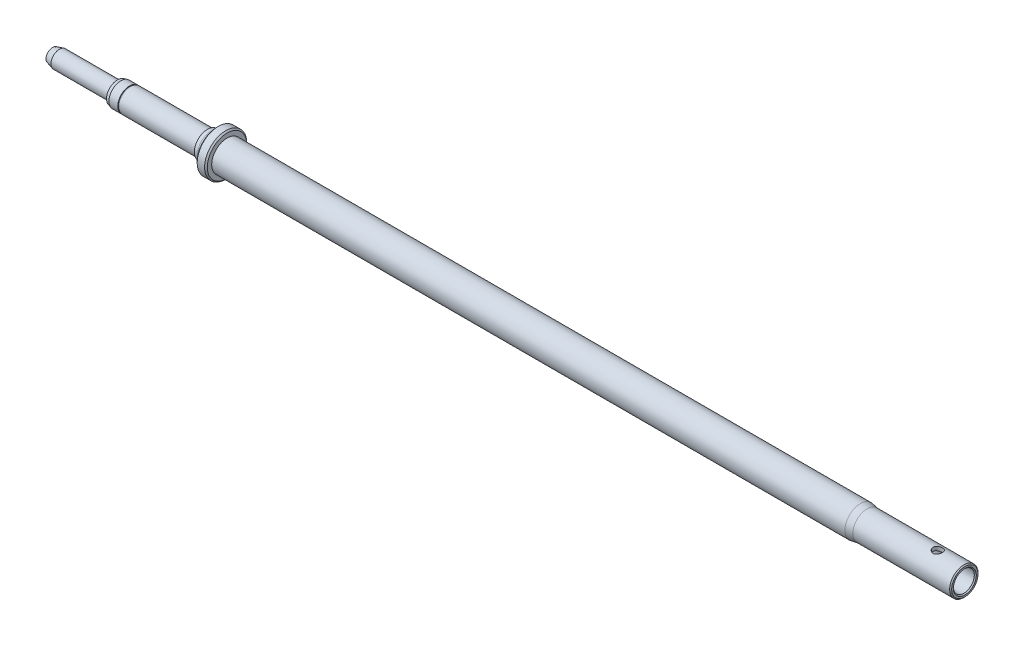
ISO-10303-21;
HEADER;
FILE_DESCRIPTION(('STEP AP214'),'2;1');
FILE_NAME('part.step','',(''),(''),'','','');
FILE_SCHEMA(('AUTOMOTIVE_DESIGN { 1 0 10303 214 1 1 1 1 }'));
ENDSEC;
DATA;
#1=APPLICATION_CONTEXT('core data for automotive mechanical design processes');
#2=APPLICATION_PROTOCOL_DEFINITION('international standard','automotive_design',2000,#1);
#3=PRODUCT_CONTEXT('',#1,'mechanical');
#4=PRODUCT('Part','Part','',(#3));
#5=PRODUCT_RELATED_PRODUCT_CATEGORY('part','',(#4));
#6=PRODUCT_DEFINITION_FORMATION('','',#4);
#7=PRODUCT_DEFINITION_CONTEXT('part definition',#1,'design');
#8=PRODUCT_DEFINITION('design','',#6,#7);
#9=PRODUCT_DEFINITION_SHAPE('','',#8);
#10=(LENGTH_UNIT() NAMED_UNIT(*) SI_UNIT(.MILLI.,.METRE.));
#11=(NAMED_UNIT(*) PLANE_ANGLE_UNIT() SI_UNIT($,.RADIAN.));
#12=(NAMED_UNIT(*) SI_UNIT($,.STERADIAN.) SOLID_ANGLE_UNIT());
#13=UNCERTAINTY_MEASURE_WITH_UNIT(LENGTH_MEASURE(1.E-05),#10,'distance_accuracy_value','');
#14=(GEOMETRIC_REPRESENTATION_CONTEXT(3) GLOBAL_UNCERTAINTY_ASSIGNED_CONTEXT((#13)) GLOBAL_UNIT_ASSIGNED_CONTEXT((#10,
#11,#12)) REPRESENTATION_CONTEXT('',''));
#15=CARTESIAN_POINT('',(0.,0.,0.));
#16=DIRECTION('',(0.,0.,1.));
#17=DIRECTION('',(1.,0.,0.));
#18=AXIS2_PLACEMENT_3D('',#15,#16,#17);
#19=CARTESIAN_POINT('',(-107.,0.,0.));
#20=DIRECTION('',(1.,0.,0.));
#21=DIRECTION('',(0.,0.,-1.));
#22=AXIS2_PLACEMENT_3D('',#19,#20,#21);
#23=CYLINDRICAL_SURFACE('',#22,17.5);
#24=CARTESIAN_POINT('',(-142.500000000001,0.,0.));
#25=DIRECTION('',(-1.,0.,0.));
#26=DIRECTION('',(0.,0.,1.));
#27=AXIS2_PLACEMENT_3D('',#24,#25,#26);
#28=CIRCLE('',#27,17.5);
#29=CARTESIAN_POINT('',(-142.500000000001,0.,17.5));
#30=VERTEX_POINT('',#29);
#31=EDGE_CURVE('E51',#30,#30,#28,.F.);
#32=ORIENTED_EDGE('',*,*,#31,.T.);
#33=EDGE_LOOP('',(#32));
#34=FACE_BOUND('',#33,.T.);
#35=CARTESIAN_POINT('',(-129.5,0.,0.));
#36=DIRECTION('',(-1.,0.,0.));
#37=DIRECTION('',(0.,0.,1.));
#38=AXIS2_PLACEMENT_3D('',#35,#36,#37);
#39=CIRCLE('',#38,17.5);
#40=CARTESIAN_POINT('',(-129.5,0.,17.5));
#41=VERTEX_POINT('',#40);
#42=EDGE_CURVE('E363',#41,#41,#39,.T.);
#43=ORIENTED_EDGE('',*,*,#42,.T.);
#44=EDGE_LOOP('',(#43));
#45=FACE_BOUND('',#44,.T.);
#46=ADVANCED_FACE('F31',(#34,#45),#23,.T.);
#47=CARTESIAN_POINT('',(-14.,0.,0.));
#48=DIRECTION('',(-1.,0.,0.));
#49=DIRECTION('',(0.,0.,1.));
#50=AXIS2_PLACEMENT_3D('',#47,#48,#49);
#51=CIRCLE('',#50,17.5);
#52=CARTESIAN_POINT('',(-14.,0.,17.5));
#53=VERTEX_POINT('',#52);
#54=EDGE_CURVE('E336',#53,#53,#51,.T.);
#55=ORIENTED_EDGE('',*,*,#54,.T.);
#56=EDGE_LOOP('',(#55));
#57=FACE_BOUND('',#56,.T.);
#58=CARTESIAN_POINT('',(-127.9,0.,0.));
#59=DIRECTION('',(-1.,0.,0.));
#60=DIRECTION('',(0.,0.,1.));
#61=AXIS2_PLACEMENT_3D('',#58,#59,#60);
#62=CIRCLE('',#61,17.5);
#63=CARTESIAN_POINT('',(-127.9,0.,17.5));
#64=VERTEX_POINT('',#63);
#65=EDGE_CURVE('E361',#64,#64,#62,.T.);
#66=ORIENTED_EDGE('',*,*,#65,.F.);
#67=EDGE_LOOP('',(#66));
#68=FACE_BOUND('',#67,.T.);
#69=ADVANCED_FACE('F148',(#57,#68),#23,.T.);
#70=CARTESIAN_POINT('',(-147.5,0.,0.));
#71=DIRECTION('',(-1.,0.,0.));
#72=DIRECTION('',(0.,0.,1.));
#73=AXIS2_PLACEMENT_3D('',#70,#71,#72);
#74=PLANE('',#73);
#75=CARTESIAN_POINT('',(-147.5,0.,0.));
#76=DIRECTION('',(-1.,0.,0.));
#77=DIRECTION('',(0.,0.,1.));
#78=AXIS2_PLACEMENT_3D('',#75,#76,#77);
#79=CIRCLE('',#78,16.1602540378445);
#80=CARTESIAN_POINT('',(-147.5,0.,16.1602540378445));
#81=VERTEX_POINT('',#80);
#82=EDGE_CURVE('E54',#81,#81,#79,.T.);
#83=ORIENTED_EDGE('',*,*,#82,.T.);
#84=EDGE_LOOP('',(#83));
#85=FACE_BOUND('',#84,.T.);
#86=CARTESIAN_POINT('',(-147.5,0.,0.));
#87=DIRECTION('',(-1.,0.,0.));
#88=DIRECTION('',(0.,0.,1.));
#89=AXIS2_PLACEMENT_3D('',#86,#87,#88);
#90=CIRCLE('',#89,12.5);
#91=CARTESIAN_POINT('',(-147.5,0.,12.5));
#92=VERTEX_POINT('',#91);
#93=EDGE_CURVE('E334',#92,#92,#90,.T.);
#94=ORIENTED_EDGE('',*,*,#93,.F.);
#95=EDGE_LOOP('',(#94));
#96=FACE_BOUND('',#95,.T.);
#97=ADVANCED_FACE('F154',(#85,#96),#74,.T.);
#98=CARTESIAN_POINT('',(-14.,0.,0.));
#99=DIRECTION('',(-1.,0.,0.));
#100=DIRECTION('',(0.,0.,1.));
#101=AXIS2_PLACEMENT_3D('',#98,#99,#100);
#102=PLANE('',#101);
#103=CARTESIAN_POINT('',(-14.,0.,0.));
#104=DIRECTION('',(-1.,0.,0.));
#105=DIRECTION('',(0.,0.,1.));
#106=AXIS2_PLACEMENT_3D('',#103,#104,#105);
#107=CIRCLE('',#106,19.5);
#108=CARTESIAN_POINT('',(-14.,0.,19.5));
#109=VERTEX_POINT('',#108);
#110=EDGE_CURVE('E87',#109,#109,#107,.T.);
#111=ORIENTED_EDGE('',*,*,#110,.T.);
#112=EDGE_LOOP('',(#111));
#113=FACE_BOUND('',#112,.T.);
#114=ORIENTED_EDGE('',*,*,#54,.F.);
#115=EDGE_LOOP('',(#114));
#116=FACE_BOUND('',#115,.T.);
#117=ADVANCED_FACE('F124',(#113,#116),#102,.T.);
#118=CARTESIAN_POINT('',(0.,0.,0.));
#119=DIRECTION('',(1.,0.,0.));
#120=DIRECTION('',(0.,0.,-1.));
#121=AXIS2_PLACEMENT_3D('',#118,#119,#120);
#122=PLANE('',#121);
#123=CARTESIAN_POINT('',(0.,0.,0.));
#124=DIRECTION('',(1.,0.,0.));
#125=DIRECTION('',(0.,0.,-1.));
#126=AXIS2_PLACEMENT_3D('',#123,#124,#125);
#127=CIRCLE('',#126,28.5);
#128=CARTESIAN_POINT('',(0.,0.,-28.5));
#129=VERTEX_POINT('',#128);
#130=EDGE_CURVE('E11',#129,#129,#127,.T.);
#131=ORIENTED_EDGE('',*,*,#130,.T.);
#132=EDGE_LOOP('',(#131));
#133=FACE_BOUND('',#132,.T.);
#134=CARTESIAN_POINT('',(0.,0.,0.));
#135=DIRECTION('',(1.,0.,0.));
#136=DIRECTION('',(0.,0.,-1.));
#137=AXIS2_PLACEMENT_3D('',#134,#135,#136);
#138=CIRCLE('',#137,29.25);
#139=CARTESIAN_POINT('',(0.,0.,-29.25));
#140=VERTEX_POINT('',#139);
#141=EDGE_CURVE('E57',#140,#140,#138,.F.);
#142=ORIENTED_EDGE('',*,*,#141,.T.);
#143=EDGE_LOOP('',(#142));
#144=FACE_BOUND('',#143,.T.);
#145=ADVANCED_FACE('F121',(#133,#144),#122,.F.);
#146=CARTESIAN_POINT('',(963.5,0.,0.));
#147=DIRECTION('',(-1.,0.,0.));
#148=DIRECTION('',(0.,0.,1.));
#149=AXIS2_PLACEMENT_3D('',#146,#147,#148);
#150=CYLINDRICAL_SURFACE('',#149,22.75);
#151=CARTESIAN_POINT('',(953.5,0.,0.));
#152=DIRECTION('',(-1.,0.,0.));
#153=DIRECTION('',(0.,0.,1.));
#154=AXIS2_PLACEMENT_3D('',#151,#152,#153);
#155=CIRCLE('',#154,22.75);
#156=CARTESIAN_POINT('',(953.5,0.,22.75));
#157=VERTEX_POINT('',#156);
#158=EDGE_CURVE('E209',#157,#157,#155,.T.);
#159=ORIENTED_EDGE('',*,*,#158,.T.);
#160=EDGE_LOOP('',(#159));
#161=FACE_BOUND('',#160,.T.);
#162=CARTESIAN_POINT('',(15.,0.,0.));
#163=DIRECTION('',(-1.,0.,0.));
#164=DIRECTION('',(0.,0.,1.));
#165=AXIS2_PLACEMENT_3D('',#162,#163,#164);
#166=CIRCLE('',#165,22.75);
#167=CARTESIAN_POINT('',(15.,0.,22.75));
#168=VERTEX_POINT('',#167);
#169=EDGE_CURVE('E69',#168,#168,#166,.T.);
#170=ORIENTED_EDGE('',*,*,#169,.F.);
#171=EDGE_LOOP('',(#170));
#172=FACE_BOUND('',#171,.T.);
#173=ADVANCED_FACE('F117',(#161,#172),#150,.T.);
#174=CARTESIAN_POINT('',(1108.5,0.,0.));
#175=DIRECTION('',(-1.,0.,0.));
#176=DIRECTION('',(0.,0.,1.));
#177=AXIS2_PLACEMENT_3D('',#174,#175,#176);
#178=CYLINDRICAL_SURFACE('',#177,21.);
#179=CARTESIAN_POINT('',(963.5,0.,0.));
#180=DIRECTION('',(-1.,0.,0.));
#181=DIRECTION('',(0.,0.,1.));
#182=AXIS2_PLACEMENT_3D('',#179,#180,#181);
#183=CIRCLE('',#182,21.);
#184=CARTESIAN_POINT('',(963.5,0.,21.));
#185=VERTEX_POINT('',#184);
#186=EDGE_CURVE('E207',#185,#185,#183,.T.);
#187=ORIENTED_EDGE('',*,*,#186,.F.);
#188=EDGE_LOOP('',(#187));
#189=FACE_BOUND('',#188,.T.);
#190=CARTESIAN_POINT('',(1107.,0.,0.));
#191=DIRECTION('',(1.,0.,0.));
#192=DIRECTION('',(0.,0.,-1.));
#193=AXIS2_PLACEMENT_3D('',#190,#191,#192);
#194=CIRCLE('',#193,21.);
#195=CARTESIAN_POINT('',(1107.,0.,-21.));
#196=VERTEX_POINT('',#195);
#197=EDGE_CURVE('E78',#196,#196,#194,.F.);
#198=ORIENTED_EDGE('',*,*,#197,.T.);
#199=EDGE_LOOP('',(#198));
#200=FACE_BOUND('',#199,.T.);
#201=CARTESIAN_POINT('',(1068.5,19.7989898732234,-6.99999999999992));
#202=CARTESIAN_POINT('',(1068.30939617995,19.7989898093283,-7.00000008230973));
#203=CARTESIAN_POINT('',(1068.11879354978,19.8017497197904,-6.99220858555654));
#204=CARTESIAN_POINT('',(1067.73894637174,19.8127016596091,-6.96111510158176));
#205=CARTESIAN_POINT('',(1067.54970234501,19.8208956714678,-6.93780745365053));
#206=CARTESIAN_POINT('',(1067.1740810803,19.8424521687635,-6.8759117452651));
#207=CARTESIAN_POINT('',(1066.98770315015,19.8558133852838,-6.83732743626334));
#208=CARTESIAN_POINT('',(1066.61901382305,19.887291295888,-6.7452213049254));
#209=CARTESIAN_POINT('',(1066.43670404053,19.9054098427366,-6.69169366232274));
#210=CARTESIAN_POINT('',(1066.07788274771,19.945800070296,-6.57032234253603));
#211=CARTESIAN_POINT('',(1065.90135848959,19.9680617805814,-6.50251298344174));
#212=CARTESIAN_POINT('',(1065.55471458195,20.0161241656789,-6.35302567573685));
#213=CARTESIAN_POINT('',(1065.38459721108,20.0419260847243,-6.271342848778));
#214=CARTESIAN_POINT('',(1065.05185931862,20.0963362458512,-6.09473563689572));
#215=CARTESIAN_POINT('',(1064.88923866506,20.1249444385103,-5.99981148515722));
#216=CARTESIAN_POINT('',(1064.57242309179,20.184192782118,-5.79736853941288));
#217=CARTESIAN_POINT('',(1064.41822851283,20.2148330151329,-5.68984923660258));
#218=CARTESIAN_POINT('',(1064.11379388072,20.2784580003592,-5.45884575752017));
#219=CARTESIAN_POINT('',(1063.96389146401,20.3114874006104,-5.33492870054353));
#220=CARTESIAN_POINT('',(1063.67500639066,20.3779489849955,-5.07515134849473));
#221=CARTESIAN_POINT('',(1063.53602037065,20.4113810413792,-4.93929475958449));
#222=CARTESIAN_POINT('',(1063.26969910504,20.4777783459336,-4.65636283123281));
#223=CARTESIAN_POINT('',(1063.14236981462,20.510743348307,-4.50928182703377));
#224=CARTESIAN_POINT('',(1062.90030588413,20.5752999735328,-4.20490454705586));
#225=CARTESIAN_POINT('',(1062.78556662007,20.6068920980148,-4.04761205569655));
#226=CARTESIAN_POINT('',(1062.56654051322,20.6686866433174,-3.71940914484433));
#227=CARTESIAN_POINT('',(1062.4626121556,20.6988298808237,-3.54824801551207));
#228=CARTESIAN_POINT('',(1062.26964362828,20.7559352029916,-3.19730250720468));
#229=CARTESIAN_POINT('',(1062.18059794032,20.7828984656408,-3.01752135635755));
#230=CARTESIAN_POINT('',(1062.01809826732,20.8328843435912,-2.65051368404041));
#231=CARTESIAN_POINT('',(1061.9446441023,20.8559070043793,-2.46328724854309));
#232=CARTESIAN_POINT('',(1061.81399798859,20.8973390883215,-2.08274846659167));
#233=CARTESIAN_POINT('',(1061.7568053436,20.9157487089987,-1.88943638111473));
#234=CARTESIAN_POINT('',(1061.66093397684,20.946857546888,-1.50500670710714));
#235=CARTESIAN_POINT('',(1061.62168052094,20.9597331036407,-1.3140466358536));
#236=CARTESIAN_POINT('',(1061.55921566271,20.9803149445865,-0.92924775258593));
#237=CARTESIAN_POINT('',(1061.53600361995,20.9880214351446,-0.735409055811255));
#238=CARTESIAN_POINT('',(1061.50585363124,20.9980446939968,-0.346372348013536));
#239=CARTESIAN_POINT('',(1061.49891223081,21.0003626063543,-0.151174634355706));
#240=CARTESIAN_POINT('',(1061.50136390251,20.9995453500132,0.239104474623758));
#241=CARTESIAN_POINT('',(1061.51075659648,20.9964103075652,0.434185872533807));
#242=CARTESIAN_POINT('',(1061.54508794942,20.9850078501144,0.81504891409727));
#243=CARTESIAN_POINT('',(1061.56939861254,20.9769478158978,1.00089379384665));
#244=CARTESIAN_POINT('',(1061.63278921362,20.9560895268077,1.36984010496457));
#245=CARTESIAN_POINT('',(1061.67187405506,20.9432896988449,1.55294060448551));
#246=CARTESIAN_POINT('',(1061.764453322,20.9132894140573,1.91502493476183));
#247=CARTESIAN_POINT('',(1061.8179431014,20.8960903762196,2.0940100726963));
#248=CARTESIAN_POINT('',(1061.93891325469,20.8577220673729,2.44682095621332));
#249=CARTESIAN_POINT('',(1062.00639890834,20.8365512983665,2.62064472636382));
#250=CARTESIAN_POINT('',(1062.15576674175,20.7904830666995,2.9641574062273));
#251=CARTESIAN_POINT('',(1062.2378216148,20.7655415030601,3.13376526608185));
#252=CARTESIAN_POINT('',(1062.41514075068,20.7127581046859,3.4655272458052));
#253=CARTESIAN_POINT('',(1062.51040953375,20.6849152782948,3.62767878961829));
#254=CARTESIAN_POINT('',(1062.71347915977,20.6270296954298,3.94352999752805));
#255=CARTESIAN_POINT('',(1062.8212807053,20.5969868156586,4.09722918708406));
#256=CARTESIAN_POINT('',(1063.04871709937,20.5354450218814,4.39529994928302));
#257=CARTESIAN_POINT('',(1063.16835237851,20.5039460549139,4.5396711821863));
#258=CARTESIAN_POINT('',(1063.42465644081,20.4387631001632,4.8248690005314));
#259=CARTESIAN_POINT('',(1063.56186321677,20.4050462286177,4.96520502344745));
#260=CARTESIAN_POINT('',(1063.84754675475,20.3377987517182,5.23384311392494));
#261=CARTESIAN_POINT('',(1063.99601997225,20.3042680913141,5.36214893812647));
#262=CARTESIAN_POINT('',(1064.30344676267,20.2382932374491,5.60601959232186));
#263=CARTESIAN_POINT('',(1064.46240581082,20.205849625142,5.72157768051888));
#264=CARTESIAN_POINT('',(1064.78969578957,20.1430032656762,5.93904281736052));
#265=CARTESIAN_POINT('',(1064.95802302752,20.1125997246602,6.04095519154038));
#266=CARTESIAN_POINT('',(1065.30559822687,20.0542870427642,6.23182809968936));
#267=CARTESIAN_POINT('',(1065.48497051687,20.0264212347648,6.32057577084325));
#268=CARTESIAN_POINT('',(1065.85106326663,19.9745851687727,6.48252880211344));
#269=CARTESIAN_POINT('',(1066.03778082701,19.9506133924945,6.55574022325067));
#270=CARTESIAN_POINT('',(1066.4172763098,19.9073407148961,6.68599283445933));
#271=CARTESIAN_POINT('',(1066.61005337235,19.888039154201,6.74303630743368));
#272=CARTESIAN_POINT('',(1067.00023361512,19.8547608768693,6.84040381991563));
#273=CARTESIAN_POINT('',(1067.19763655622,19.8407838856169,6.88072872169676));
#274=CARTESIAN_POINT('',(1067.58651906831,19.8191440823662,6.94280613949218));
#275=CARTESIAN_POINT('',(1067.77786394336,19.8112247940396,6.96531465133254));
#276=CARTESIAN_POINT('',(1068.161904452,19.8009462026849,6.99448151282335));
#277=CARTESIAN_POINT('',(1068.35460003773,19.7985867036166,7.00114042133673));
#278=CARTESIAN_POINT('',(1068.73983818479,19.7995056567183,6.99854105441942));
#279=CARTESIAN_POINT('',(1068.93238076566,19.8027832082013,6.98928532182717));
#280=CARTESIAN_POINT('',(1069.31587275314,19.814866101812,6.95495589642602));
#281=CARTESIAN_POINT('',(1069.5068221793,19.8236713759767,6.9298823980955));
#282=CARTESIAN_POINT('',(1069.87913913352,19.8461253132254,6.86530634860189));
#283=CARTESIAN_POINT('',(1070.06060960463,19.8595958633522,6.82633303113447));
#284=CARTESIAN_POINT('',(1070.41957944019,19.8910231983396,6.73420841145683));
#285=CARTESIAN_POINT('',(1070.59707746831,19.9089814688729,6.6810524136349));
#286=CARTESIAN_POINT('',(1070.94686460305,19.9488585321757,6.56102410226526));
#287=CARTESIAN_POINT('',(1071.11915486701,19.9707764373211,6.4941548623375));
#288=CARTESIAN_POINT('',(1071.45758944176,20.0179729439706,6.3471816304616));
#289=CARTESIAN_POINT('',(1071.62373138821,20.0432528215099,6.26707261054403));
#290=CARTESIAN_POINT('',(1071.95394763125,20.0973231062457,6.09149413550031));
#291=CARTESIAN_POINT('',(1072.11779377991,20.1261987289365,5.9956218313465));
#292=CARTESIAN_POINT('',(1072.4369547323,20.1860106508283,5.79105602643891));
#293=CARTESIAN_POINT('',(1072.59226656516,20.2169476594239,5.68235810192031));
#294=CARTESIAN_POINT('',(1072.89342701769,20.280052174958,5.45285650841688));
#295=CARTESIAN_POINT('',(1073.03927478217,20.312219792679,5.33205174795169));
#296=CARTESIAN_POINT('',(1073.32066248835,20.3769486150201,5.07907567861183));
#297=CARTESIAN_POINT('',(1073.45620219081,20.4095098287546,4.94690410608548));
#298=CARTESIAN_POINT('',(1073.72247587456,20.4757619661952,4.66530668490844));
#299=CARTESIAN_POINT('',(1073.85266035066,20.5094313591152,4.51535549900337));
#300=CARTESIAN_POINT('',(1074.09991645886,20.5753460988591,4.20479709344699));
#301=CARTESIAN_POINT('',(1074.21699246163,20.6075919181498,4.04419345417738));
#302=CARTESIAN_POINT('',(1074.43729084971,20.6697907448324,3.7132339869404));
#303=CARTESIAN_POINT('',(1074.54050796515,20.6997428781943,3.54287448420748));
#304=CARTESIAN_POINT('',(1074.73220002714,20.7564914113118,3.1936408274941));
#305=CARTESIAN_POINT('',(1074.82068115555,20.7832891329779,3.01477028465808));
#306=CARTESIAN_POINT('',(1074.98171475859,20.8328296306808,2.65079768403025));
#307=CARTESIAN_POINT('',(1075.05436256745,20.8555965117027,2.46574112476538));
#308=CARTESIAN_POINT('',(1075.18374912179,20.8966202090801,2.08973897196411));
#309=CARTESIAN_POINT('',(1075.24049422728,20.9148788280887,1.89879576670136));
#310=CARTESIAN_POINT('',(1075.33756921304,20.9463658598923,1.51239071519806));
#311=CARTESIAN_POINT('',(1075.37790070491,20.9595947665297,1.3169293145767));
#312=CARTESIAN_POINT('',(1075.44175002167,20.9806334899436,0.9229934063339));
#313=CARTESIAN_POINT('',(1075.4652685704,20.9884435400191,0.724519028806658));
#314=CARTESIAN_POINT('',(1075.49454500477,20.99817806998,0.335524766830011));
#315=CARTESIAN_POINT('',(1075.50108638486,21.0003621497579,0.145069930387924));
#316=CARTESIAN_POINT('',(1075.4986200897,20.9995400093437,-0.235726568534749));
#317=CARTESIAN_POINT('',(1075.48961272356,20.996533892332,-0.426068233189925));
#318=CARTESIAN_POINT('',(1075.45613705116,20.9854138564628,-0.805216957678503));
#319=CARTESIAN_POINT('',(1075.43167010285,20.9773003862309,-0.994024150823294));
#320=CARTESIAN_POINT('',(1075.36750678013,20.9561860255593,-1.36875331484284));
#321=CARTESIAN_POINT('',(1075.32781036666,20.9431851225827,-1.55467527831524));
#322=CARTESIAN_POINT('',(1075.23430921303,20.9128907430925,-1.91936009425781));
#323=CARTESIAN_POINT('',(1075.18074210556,20.8956698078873,-2.09819003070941));
#324=CARTESIAN_POINT('',(1075.05964158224,20.8572673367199,-2.45068233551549));
#325=CARTESIAN_POINT('',(1074.99210349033,20.8360844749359,-2.62434295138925));
#326=CARTESIAN_POINT('',(1074.84361726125,20.7902981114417,-2.96531471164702));
#327=CARTESIAN_POINT('',(1074.76267203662,20.7656953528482,-3.13262722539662));
#328=CARTESIAN_POINT('',(1074.58791970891,20.7136623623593,-3.46001136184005));
#329=CARTESIAN_POINT('',(1074.49410774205,20.6862310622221,-3.62008021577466));
#330=CARTESIAN_POINT('',(1074.29061940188,20.6281705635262,-3.93771390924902));
#331=CARTESIAN_POINT('',(1074.1804880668,20.5974610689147,-4.09497269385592));
#332=CARTESIAN_POINT('',(1073.94781609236,20.5345113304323,-4.39978136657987));
#333=CARTESIAN_POINT('',(1073.82527113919,20.5022705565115,-4.54732785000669));
#334=CARTESIAN_POINT('',(1073.56856191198,20.437096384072,-4.83181041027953));
#335=CARTESIAN_POINT('',(1073.43439615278,20.4041628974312,-4.96874512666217));
#336=CARTESIAN_POINT('',(1073.15526778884,20.3384640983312,-5.23117376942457));
#337=CARTESIAN_POINT('',(1073.01030505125,20.3056987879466,-5.35666755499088));
#338=CARTESIAN_POINT('',(1072.70451606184,20.2399307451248,-5.60015451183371));
#339=CARTESIAN_POINT('',(1072.54328976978,20.2069695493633,-5.71765714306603));
#340=CARTESIAN_POINT('',(1072.21116541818,20.1431429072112,-5.93860403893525));
#341=CARTESIAN_POINT('',(1072.04027080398,20.1122767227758,-6.04205326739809));
#342=CARTESIAN_POINT('',(1071.6898247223,20.0535568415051,-6.23417637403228));
#343=CARTESIAN_POINT('',(1071.51027161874,20.0257037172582,-6.32284744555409));
#344=CARTESIAN_POINT('',(1071.1438274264,19.9739067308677,-6.4846177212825));
#345=CARTESIAN_POINT('',(1070.95693968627,19.9499611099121,-6.55772393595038));
#346=CARTESIAN_POINT('',(1070.58560553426,19.9077187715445,-6.68483486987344));
#347=CARTESIAN_POINT('',(1070.40142512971,19.8892169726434,-6.7395488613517));
#348=CARTESIAN_POINT('',(1070.02885928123,19.8570639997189,-6.83370236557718));
#349=CARTESIAN_POINT('',(1069.84047560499,19.8434108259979,-6.87314817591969));
#350=CARTESIAN_POINT('',(1069.46081464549,19.8213838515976,-6.93641601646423));
#351=CARTESIAN_POINT('',(1069.26953766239,19.8130095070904,-6.96023965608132));
#352=CARTESIAN_POINT('',(1068.88550670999,19.8018125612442,-6.99203157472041));
#353=CARTESIAN_POINT('',(1068.69275274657,19.7989899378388,-6.99999991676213));
#354=CARTESIAN_POINT('',(1068.5,19.7989898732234,-6.99999999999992));
#355=B_SPLINE_CURVE_WITH_KNOTS('',3,(#201,#202,#203,#204,#205,#206,#207,#208,#209,#210,#211,
#212,#213,#214,#215,#216,#217,#218,#219,#220,#221,#222,#223,#224,#225,#226,#227,#228,#229,#230,
#231,#232,#233,#234,#235,#236,#237,#238,#239,#240,#241,#242,#243,#244,#245,#246,#247,#248,#249,
#250,#251,#252,#253,#254,#255,#256,#257,#258,#259,#260,#261,#262,#263,#264,#265,#266,#267,#268,
#269,#270,#271,#272,#273,#274,#275,#276,#277,#278,#279,#280,#281,#282,#283,#284,#285,#286,#287,
#288,#289,#290,#291,#292,#293,#294,#295,#296,#297,#298,#299,#300,#301,#302,#303,#304,#305,#306,
#307,#308,#309,#310,#311,#312,#313,#314,#315,#316,#317,#318,#319,#320,#321,#322,#323,#324,#325,
#326,#327,#328,#329,#330,#331,#332,#333,#334,#335,#336,#337,#338,#339,#340,#341,#342,#343,#344,
#345,#346,#347,#348,#349,#350,#351,#352,#353,#354),.UNSPECIFIED.,.T.,.F.,(4,2,2,2,2,2,2,2,2,2,2,
2,2,2,2,2,2,2,2,2,2,2,2,2,2,2,2,2,2,2,2,2,2,2,2,2,2,2,2,2,2,2,2,2,2,2,2,2,2,2,2,2,2,2,2,2,2,2,2,
2,2,2,2,2,2,2,2,2,2,2,2,2,2,2,2,2,4),(0.,0.571631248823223,1.14347115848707,1.71517072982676,
2.28709328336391,2.85765690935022,3.42842158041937,3.99917620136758,4.56995388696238,
5.1611060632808,5.75207538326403,6.34334495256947,6.93439663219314,7.54114407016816,
8.14766603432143,8.75418099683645,9.36066998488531,9.94606516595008,10.5314369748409,
11.1166844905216,11.7019184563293,12.2640617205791,12.8263917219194,13.388540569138,
13.9509018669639,14.5204380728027,15.0901695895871,15.6599330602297,16.2297172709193,
16.8264489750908,17.4229937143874,18.0198524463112,18.6164775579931,19.2218898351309,
19.8270654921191,20.4321556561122,21.0372146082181,21.6149690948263,22.192703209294,
22.770345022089,23.3479797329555,23.9056293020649,24.4634637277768,25.0211732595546,
25.5790950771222,26.154509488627,26.7301229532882,27.3057883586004,27.8814671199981,
28.4849894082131,29.0883098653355,29.6918590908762,30.2951544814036,30.8947103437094,
31.4940260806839,32.0932829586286,32.692514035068,33.2635544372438,33.8345834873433,
34.4055623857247,34.9765427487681,35.5383229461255,36.1002914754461,36.6621380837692,
37.2241976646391,37.8068280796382,38.3896616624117,38.9725698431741,39.5554851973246,
40.1613742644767,40.7670487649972,41.3728381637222,41.9783541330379,42.5567308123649,
43.1348686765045,43.7129469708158,44.2910229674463),.UNSPECIFIED.);
#356=CARTESIAN_POINT('',(1068.5,19.7989898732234,-6.99999999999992));
#357=VERTEX_POINT('',#356);
#358=EDGE_CURVE('E86',#357,#357,#355,.T.);
#359=ORIENTED_EDGE('',*,*,#358,.F.);
#360=EDGE_LOOP('',(#359));
#361=FACE_BOUND('',#360,.T.);
#362=ADVANCED_FACE('F112',(#189,#200,#361),#178,.T.);
#363=CARTESIAN_POINT('',(90.5,0.,0.));
#364=DIRECTION('',(1.,0.,0.));
#365=DIRECTION('',(0.,0.,-1.));
#366=AXIS2_PLACEMENT_3D('',#363,#364,#365);
#367=CYLINDRICAL_SURFACE('',#366,15.5);
#368=CARTESIAN_POINT('',(1107.,0.,0.));
#369=DIRECTION('',(1.,0.,0.));
#370=DIRECTION('',(0.,0.,-1.));
#371=AXIS2_PLACEMENT_3D('',#368,#369,#370);
#372=CIRCLE('',#371,15.5);
#373=CARTESIAN_POINT('',(1107.,0.,-15.5));
#374=VERTEX_POINT('',#373);
#375=EDGE_CURVE('E75',#374,#374,#372,.T.);
#376=ORIENTED_EDGE('',*,*,#375,.T.);
#377=EDGE_LOOP('',(#376));
#378=FACE_BOUND('',#377,.T.);
#379=CARTESIAN_POINT('',(90.5,0.,0.));
#380=DIRECTION('',(1.,0.,0.));
#381=DIRECTION('',(0.,0.,-1.));
#382=AXIS2_PLACEMENT_3D('',#379,#380,#381);
#383=CIRCLE('',#382,15.5);
#384=CARTESIAN_POINT('',(90.5,0.,-15.5));
#385=VERTEX_POINT('',#384);
#386=EDGE_CURVE('E109',#385,#385,#383,.T.);
#387=ORIENTED_EDGE('',*,*,#386,.F.);
#388=EDGE_LOOP('',(#387));
#389=FACE_BOUND('',#388,.T.);
#390=CARTESIAN_POINT('',(1068.5,13.8293166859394,-6.99999999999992));
#391=CARTESIAN_POINT('',(1068.68506496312,13.8293183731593,-6.99999852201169));
#392=CARTESIAN_POINT('',(1068.87017645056,13.8330444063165,-6.99265049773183));
#393=CARTESIAN_POINT('',(1069.23902275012,13.8478212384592,-6.96334022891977));
#394=CARTESIAN_POINT('',(1069.42275670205,13.8588762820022,-6.94136951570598));
#395=CARTESIAN_POINT('',(1069.7877272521,13.8879476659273,-6.88302055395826));
#396=CARTESIAN_POINT('',(1069.96895837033,13.9059773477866,-6.84661468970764));
#397=CARTESIAN_POINT('',(1070.32734245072,13.9483867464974,-6.75979559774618));
#398=CARTESIAN_POINT('',(1070.50449364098,13.9727691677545,-6.7093764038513));
#399=CARTESIAN_POINT('',(1070.85263160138,14.026954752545,-6.59533932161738));
#400=CARTESIAN_POINT('',(1071.02364490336,14.0567300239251,-6.53178911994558));
#401=CARTESIAN_POINT('',(1071.35949500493,14.1208886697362,-6.39190248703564));
#402=CARTESIAN_POINT('',(1071.52432940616,14.1552738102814,-6.3155611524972));
#403=CARTESIAN_POINT('',(1072.00803187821,14.2638617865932,-6.0683339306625));
#404=CARTESIAN_POINT('',(1072.31649346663,14.3435621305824,-5.87911443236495));
#405=CARTESIAN_POINT('',(1072.91897440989,14.515102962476,-5.44244234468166));
#406=CARTESIAN_POINT('',(1073.21066082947,14.6073985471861,-5.19194901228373));
#407=CARTESIAN_POINT('',(1073.6147039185,14.7442918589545,-4.78295409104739));
#408=CARTESIAN_POINT('',(1073.74388293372,14.789696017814,-4.64096833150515));
#409=CARTESIAN_POINT('',(1073.99035989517,14.8788726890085,-4.34658032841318));
#410=CARTESIAN_POINT('',(1074.10766188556,14.9226457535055,-4.19418166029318));
#411=CARTESIAN_POINT('',(1074.33553579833,15.0097237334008,-3.8713829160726));
#412=CARTESIAN_POINT('',(1074.44541964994,15.0528803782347,-3.7004566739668));
#413=CARTESIAN_POINT('',(1074.65025016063,15.1349520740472,-3.34899520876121));
#414=CARTESIAN_POINT('',(1074.74520304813,15.1738688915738,-3.16846403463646));
#415=CARTESIAN_POINT('',(1074.91931868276,15.2463564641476,-2.79893819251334));
#416=CARTESIAN_POINT('',(1074.99848411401,15.279928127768,-2.60994496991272));
#417=CARTESIAN_POINT('',(1075.14019365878,15.3407324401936,-2.224840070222));
#418=CARTESIAN_POINT('',(1075.20273916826,15.3679656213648,-2.02872899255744));
#419=CARTESIAN_POINT('',(1075.30724131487,15.4138401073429,-1.64286181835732));
#420=CARTESIAN_POINT('',(1075.35020637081,15.4328981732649,-1.45342813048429));
#421=CARTESIAN_POINT('',(1075.42029847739,15.4641373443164,-1.07109087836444));
#422=CARTESIAN_POINT('',(1075.44742610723,15.4763187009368,-0.878187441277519));
#423=CARTESIAN_POINT('',(1075.48550462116,15.4934497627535,-0.490549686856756));
#424=CARTESIAN_POINT('',(1075.49646210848,15.4984024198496,-0.295816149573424));
#425=CARTESIAN_POINT('',(1075.50208217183,15.500940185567,0.0939299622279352));
#426=CARTESIAN_POINT('',(1075.49674551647,15.4985256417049,0.28894252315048));
#427=CARTESIAN_POINT('',(1075.470812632,15.4868366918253,0.663691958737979));
#428=CARTESIAN_POINT('',(1075.45133568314,15.4780655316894,0.843523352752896));
#429=CARTESIAN_POINT('',(1075.3985989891,15.4544528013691,1.2008126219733));
#430=CARTESIAN_POINT('',(1075.36533450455,15.4396091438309,1.37826965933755));
#431=CARTESIAN_POINT('',(1075.28537560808,15.4042214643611,1.7294808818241));
#432=CARTESIAN_POINT('',(1075.23868579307,15.3836793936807,1.90323631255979));
#433=CARTESIAN_POINT('',(1075.13230039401,15.3373764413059,2.24606825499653));
#434=CARTESIAN_POINT('',(1075.0725998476,15.3116135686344,2.41514295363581));
#435=CARTESIAN_POINT('',(1074.93974599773,15.2550536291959,2.75001553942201));
#436=CARTESIAN_POINT('',(1074.8664072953,15.2241879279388,2.91572833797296));
#437=CARTESIAN_POINT('',(1074.70747746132,15.158415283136,3.24035988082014));
#438=CARTESIAN_POINT('',(1074.62188187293,15.1235068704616,3.39927612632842));
#439=CARTESIAN_POINT('',(1074.34762452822,15.0138780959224,3.86454629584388));
#440=CARTESIAN_POINT('',(1074.14140999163,14.9342179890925,4.15962733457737));
#441=CARTESIAN_POINT('',(1073.66915147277,14.7620434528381,4.73602533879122));
#442=CARTESIAN_POINT('',(1073.39962271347,14.6690104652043,5.01431096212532));
#443=CARTESIAN_POINT('',(1072.81766223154,14.4850345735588,5.52331960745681));
#444=CARTESIAN_POINT('',(1072.50520793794,14.3940927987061,5.75401744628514));
#445=CARTESIAN_POINT('',(1072.00230838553,14.2649317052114,6.06424530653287));
#446=CARTESIAN_POINT('',(1071.82480827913,14.2222655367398,6.16337193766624));
#447=CARTESIAN_POINT('',(1071.46102158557,14.1416491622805,6.34615814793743));
#448=CARTESIAN_POINT('',(1071.27473894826,14.1036968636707,6.42982459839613));
#449=CARTESIAN_POINT('',(1070.89467070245,14.0338722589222,6.58083272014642));
#450=CARTESIAN_POINT('',(1070.7008885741,14.0019971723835,6.64818186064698));
#451=CARTESIAN_POINT('',(1070.30717608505,13.9455354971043,6.765818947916));
#452=CARTESIAN_POINT('',(1070.10724639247,13.9209481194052,6.81610874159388));
#453=CARTESIAN_POINT('',(1069.71749111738,13.8815505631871,6.89596908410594));
#454=CARTESIAN_POINT('',(1069.52797585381,13.8661634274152,6.9267717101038));
#455=CARTESIAN_POINT('',(1069.14658870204,13.8431160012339,6.97271869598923));
#456=CARTESIAN_POINT('',(1068.95471693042,13.835455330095,6.98786382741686));
#457=CARTESIAN_POINT('',(1068.57030204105,13.8281605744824,7.00228824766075));
#458=CARTESIAN_POINT('',(1068.37775921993,13.8285233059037,7.00157383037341));
#459=CARTESIAN_POINT('',(1067.99357377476,13.8372537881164,6.98430396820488));
#460=CARTESIAN_POINT('',(1067.80193111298,13.8456212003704,6.96774919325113));
#461=CARTESIAN_POINT('',(1067.43663275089,13.8690395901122,6.92100828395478));
#462=CARTESIAN_POINT('',(1067.26278089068,13.8834922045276,6.89203915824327));
#463=CARTESIAN_POINT('',(1066.91827772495,13.9184219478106,6.82122338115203));
#464=CARTESIAN_POINT('',(1066.74762752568,13.9389011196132,6.77937236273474));
#465=CARTESIAN_POINT('',(1066.41066762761,13.9852586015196,6.68321668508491));
#466=CARTESIAN_POINT('',(1066.24435716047,14.0111359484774,6.62891424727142));
#467=CARTESIAN_POINT('',(1065.91690047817,14.0675646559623,6.50830662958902));
#468=CARTESIAN_POINT('',(1065.75575628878,14.0981178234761,6.44199680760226));
#469=CARTESIAN_POINT('',(1065.43240456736,14.1645328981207,6.29466627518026));
#470=CARTESIAN_POINT('',(1065.27047319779,14.2005713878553,6.21311935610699));
#471=CARTESIAN_POINT('',(1064.95393769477,14.2758856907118,6.03805986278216));
#472=CARTESIAN_POINT('',(1064.79933607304,14.3151626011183,5.94454322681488));
#473=CARTESIAN_POINT('',(1064.49818430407,14.3959535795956,5.74612859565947));
#474=CARTESIAN_POINT('',(1064.35163604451,14.4374681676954,5.641227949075));
#475=CARTESIAN_POINT('',(1064.06727145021,14.5217298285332,5.42063678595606));
#476=CARTESIAN_POINT('',(1063.92945559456,14.5644769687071,5.30494567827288));
#477=CARTESIAN_POINT('',(1063.64998459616,14.6544687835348,5.05137456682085));
#478=CARTESIAN_POINT('',(1063.50930017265,14.7017397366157,4.91243175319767));
#479=CARTESIAN_POINT('',(1063.24007832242,14.7952981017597,4.62301573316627));
#480=CARTESIAN_POINT('',(1063.11153730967,14.8415858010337,4.47254595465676));
#481=CARTESIAN_POINT('',(1062.86729641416,14.9319948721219,4.16075549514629));
#482=CARTESIAN_POINT('',(1062.75160397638,14.976114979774,3.99942860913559));
#483=CARTESIAN_POINT('',(1062.5340305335,15.0609680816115,3.66696827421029));
#484=CARTESIAN_POINT('',(1062.4321435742,15.101702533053,3.49583909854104));
#485=CARTESIAN_POINT('',(1062.24192881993,15.1791245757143,3.14279881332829));
#486=CARTESIAN_POINT('',(1062.15376164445,15.2157629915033,2.96079019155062));
#487=CARTESIAN_POINT('',(1061.99323537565,15.2834121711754,2.5890129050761));
#488=CARTESIAN_POINT('',(1061.9208690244,15.3144255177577,2.39924785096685));
#489=CARTESIAN_POINT('',(1061.79270605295,15.3699204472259,2.01333787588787));
#490=CARTESIAN_POINT('',(1061.73690374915,15.3944042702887,1.81719516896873));
#491=CARTESIAN_POINT('',(1061.642516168,15.436103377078,1.42005647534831));
#492=CARTESIAN_POINT('',(1061.60392930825,15.4533193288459,1.21906093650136));
#493=CARTESIAN_POINT('',(1061.54683688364,15.4788851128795,0.830082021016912));
#494=CARTESIAN_POINT('',(1061.52697811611,15.4878312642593,0.642335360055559));
#495=CARTESIAN_POINT('',(1061.50249736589,15.4988683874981,0.265654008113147));
#496=CARTESIAN_POINT('',(1061.49787453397,15.5009597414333,0.0767193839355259));
#497=CARTESIAN_POINT('',(1061.50391908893,15.4982302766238,-0.300813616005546));
#498=CARTESIAN_POINT('',(1061.51458332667,15.4934108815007,-0.489412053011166));
#499=CARTESIAN_POINT('',(1061.5510701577,15.476994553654,-0.864835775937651));
#500=CARTESIAN_POINT('',(1061.57689255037,15.465397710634,-1.0516610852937));
#501=CARTESIAN_POINT('',(1061.6418277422,15.4364415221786,-1.413375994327));
#502=CARTESIAN_POINT('',(1061.68025639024,15.4193797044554,-1.58841299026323));
#503=CARTESIAN_POINT('',(1061.77024103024,15.3797926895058,-1.93450907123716));
#504=CARTESIAN_POINT('',(1061.82180157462,15.3572655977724,-2.10556675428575));
#505=CARTESIAN_POINT('',(1061.93755636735,15.3072840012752,-2.44255350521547));
#506=CARTESIAN_POINT('',(1062.00174736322,15.2798307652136,-2.60848388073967));
#507=CARTESIAN_POINT('',(1062.142261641,15.2206037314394,-2.93439402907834));
#508=CARTESIAN_POINT('',(1062.21858955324,15.1888282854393,-3.09437150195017));
#509=CARTESIAN_POINT('',(1062.38651983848,15.1201357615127,-3.41460316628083));
#510=CARTESIAN_POINT('',(1062.47865839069,15.0830507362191,-3.57454010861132));
#511=CARTESIAN_POINT('',(1062.67491430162,15.0057817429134,-3.88616763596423));
#512=CARTESIAN_POINT('',(1062.77903577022,14.9655967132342,-4.03785536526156));
#513=CARTESIAN_POINT('',(1062.99858804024,14.883050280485,-4.33222663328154));
#514=CARTESIAN_POINT('',(1063.11402102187,14.8406884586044,-4.4749084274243));
#515=CARTESIAN_POINT('',(1063.35552718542,14.7547573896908,-4.75057719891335));
#516=CARTESIAN_POINT('',(1063.48160089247,14.7111880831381,-4.88356369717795));
#517=CARTESIAN_POINT('',(1063.75447709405,14.6202638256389,-5.14968357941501));
#518=CARTESIAN_POINT('',(1063.902131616,14.572890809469,-5.28193869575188));
#519=CARTESIAN_POINT('',(1064.20827356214,14.479215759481,-5.53356424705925));
#520=CARTESIAN_POINT('',(1064.36675760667,14.4329133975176,-5.65293867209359));
#521=CARTESIAN_POINT('',(1064.69393591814,14.3426419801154,-5.87821099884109));
#522=CARTESIAN_POINT('',(1064.8626411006,14.2986755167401,-5.98409410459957));
#523=CARTESIAN_POINT('',(1065.20910265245,14.2144922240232,-6.18140076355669));
#524=CARTESIAN_POINT('',(1065.38685490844,14.1742737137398,-6.27283081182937));
#525=CARTESIAN_POINT('',(1065.75176435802,14.0986069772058,-6.44110713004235));
#526=CARTESIAN_POINT('',(1065.93898089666,14.0631958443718,-6.51784168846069));
#527=CARTESIAN_POINT('',(1066.32025769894,13.9987858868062,-6.65505401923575));
#528=CARTESIAN_POINT('',(1066.51431446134,13.9697838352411,-6.71553997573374));
#529=CARTESIAN_POINT('',(1066.90735598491,13.9193617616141,-6.81943537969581));
#530=CARTESIAN_POINT('',(1067.10632635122,13.8979218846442,-6.8628895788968));
#531=CARTESIAN_POINT('',(1067.5079036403,13.8634163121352,-6.93233066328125));
#532=CARTESIAN_POINT('',(1067.71050773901,13.8503443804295,-6.95833055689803));
#533=CARTESIAN_POINT('',(1068.01137265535,13.8376029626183,-6.98361013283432));
#534=CARTESIAN_POINT('',(1068.10896346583,13.8344991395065,-6.98975347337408));
#535=CARTESIAN_POINT('',(1068.30436517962,13.8303555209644,-6.99794886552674));
#536=CARTESIAN_POINT('',(1068.40217609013,13.8293157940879,-7.00000078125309));
#537=CARTESIAN_POINT('',(1068.5,13.8293166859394,-6.99999999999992));
#538=B_SPLINE_CURVE_WITH_KNOTS('',3,(#390,#391,#392,#393,#394,#395,#396,#397,#398,#399,#400,
#401,#402,#403,#404,#405,#406,#407,#408,#409,#410,#411,#412,#413,#414,#415,#416,#417,#418,#419,
#420,#421,#422,#423,#424,#425,#426,#427,#428,#429,#430,#431,#432,#433,#434,#435,#436,#437,#438,
#439,#440,#441,#442,#443,#444,#445,#446,#447,#448,#449,#450,#451,#452,#453,#454,#455,#456,#457,
#458,#459,#460,#461,#462,#463,#464,#465,#466,#467,#468,#469,#470,#471,#472,#473,#474,#475,#476,
#477,#478,#479,#480,#481,#482,#483,#484,#485,#486,#487,#488,#489,#490,#491,#492,#493,#494,#495,
#496,#497,#498,#499,#500,#501,#502,#503,#504,#505,#506,#507,#508,#509,#510,#511,#512,#513,#514,
#515,#516,#517,#518,#519,#520,#521,#522,#523,#524,#525,#526,#527,#528,#529,#530,#531,#532,#533,
#534,#535,#536,#537),.UNSPECIFIED.,.T.,.F.,(4,2,2,2,2,2,2,2,2,2,2,2,2,2,2,2,2,2,2,2,2,2,2,2,2,2,
2,2,2,2,2,2,2,2,2,2,2,2,2,2,2,2,2,2,2,2,2,2,2,2,2,2,2,2,2,2,2,2,2,2,2,2,2,2,2,2,2,2,2,2,2,2,2,
4),(0.,0.555093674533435,1.11050910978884,1.66699227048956,2.2237127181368,2.7776319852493,
3.33176407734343,4.43878176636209,5.61958428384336,6.21081810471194,6.80184992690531,
7.42426425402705,8.04641824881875,8.6684663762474,9.29046223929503,9.87522147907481,
10.4599593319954,11.0444583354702,11.628929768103,12.1715772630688,12.7144114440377,
13.2570599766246,13.7999158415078,14.3507769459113,14.9018388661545,16.0032967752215,
17.1936220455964,18.3845756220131,19.0070992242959,19.6293454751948,20.2513063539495,
20.87319987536,21.4502711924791,22.0273140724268,22.6041279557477,23.1809174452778,
23.7108366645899,24.2409357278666,24.7709402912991,25.301150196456,25.8551284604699,
26.4092952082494,26.9635913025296,27.5179177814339,28.1271243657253,28.7361504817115,
29.3455276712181,29.9546411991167,30.5704218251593,31.1859190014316,31.8012047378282,
32.4164339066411,32.9827250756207,33.5489846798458,34.1151276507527,34.6812631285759,
35.2207016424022,35.760327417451,36.2998144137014,36.8395077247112,37.403705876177,
37.9680981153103,38.5325993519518,39.0971284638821,39.7078475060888,40.3183768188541,
40.9295700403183,41.5404878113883,42.1558797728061,42.7709611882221,43.3844154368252,
43.9974119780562,44.2908204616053,44.5842386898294),.UNSPECIFIED.);
#539=CARTESIAN_POINT('',(1068.5,13.8293166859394,-6.99999999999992));
#540=VERTEX_POINT('',#539);
#541=EDGE_CURVE('E79',#540,#540,#538,.T.);
#542=ORIENTED_EDGE('',*,*,#541,.F.);
#543=EDGE_LOOP('',(#542));
#544=FACE_BOUND('',#543,.T.);
#545=ADVANCED_FACE('F89',(#378,#389,#544),#367,.F.);
#546=CARTESIAN_POINT('',(1108.5,0.,0.));
#547=DIRECTION('',(1.,0.,0.));
#548=DIRECTION('',(0.,0.,-1.));
#549=AXIS2_PLACEMENT_3D('',#546,#547,#548);
#550=PLANE('',#549);
#551=CARTESIAN_POINT('',(1108.5,0.,0.));
#552=DIRECTION('',(1.,0.,0.));
#553=DIRECTION('',(0.,0.,-1.));
#554=AXIS2_PLACEMENT_3D('',#551,#552,#553);
#555=CIRCLE('',#554,17.0000000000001);
#556=CARTESIAN_POINT('',(1108.5,0.,-17.0000000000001));
#557=VERTEX_POINT('',#556);
#558=EDGE_CURVE('E72',#557,#557,#555,.F.);
#559=ORIENTED_EDGE('',*,*,#558,.T.);
#560=EDGE_LOOP('',(#559));
#561=FACE_BOUND('',#560,.T.);
#562=CARTESIAN_POINT('',(1108.5,0.,0.));
#563=DIRECTION('',(1.,0.,0.));
#564=DIRECTION('',(0.,0.,-1.));
#565=AXIS2_PLACEMENT_3D('',#562,#563,#564);
#566=CIRCLE('',#565,19.4999999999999);
#567=CARTESIAN_POINT('',(1108.5,0.,-19.4999999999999));
#568=VERTEX_POINT('',#567);
#569=EDGE_CURVE('E213',#568,#568,#566,.T.);
#570=ORIENTED_EDGE('',*,*,#569,.T.);
#571=EDGE_LOOP('',(#570));
#572=FACE_BOUND('',#571,.T.);
#573=ADVANCED_FACE('F119',(#561,#572),#550,.T.);
#574=CARTESIAN_POINT('',(1108.5,0.,0.));
#575=DIRECTION('',(-1.,0.,0.));
#576=DIRECTION('',(0.,0.,1.));
#577=AXIS2_PLACEMENT_3D('',#574,#575,#576);
#578=CONICAL_SURFACE('',#577,19.4999999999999,0.78539816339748);
#579=ORIENTED_EDGE('',*,*,#197,.F.);
#580=EDGE_LOOP('',(#579));
#581=FACE_BOUND('',#580,.T.);
#582=ORIENTED_EDGE('',*,*,#569,.F.);
#583=EDGE_LOOP('',(#582));
#584=FACE_BOUND('',#583,.T.);
#585=ADVANCED_FACE('F222',(#581,#584),#578,.T.);
#586=CARTESIAN_POINT('',(953.5,0.,0.));
#587=DIRECTION('',(-1.,0.,0.));
#588=DIRECTION('',(0.,0.,1.));
#589=AXIS2_PLACEMENT_3D('',#586,#587,#588);
#590=CONICAL_SURFACE('',#589,22.75,0.173245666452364);
#591=ORIENTED_EDGE('',*,*,#186,.T.);
#592=EDGE_LOOP('',(#591));
#593=FACE_BOUND('',#592,.T.);
#594=ORIENTED_EDGE('',*,*,#158,.F.);
#595=EDGE_LOOP('',(#594));
#596=FACE_BOUND('',#595,.T.);
#597=ADVANCED_FACE('F225',(#593,#596),#590,.T.);
#598=CARTESIAN_POINT('',(90.5,0.,0.));
#599=DIRECTION('',(1.,0.,0.));
#600=DIRECTION('',(0.,0.,-1.));
#601=AXIS2_PLACEMENT_3D('',#598,#599,#600);
#602=PLANE('',#601);
#603=CARTESIAN_POINT('',(90.5,0.,0.));
#604=DIRECTION('',(1.,0.,0.));
#605=DIRECTION('',(0.,0.,-1.));
#606=AXIS2_PLACEMENT_3D('',#603,#604,#605);
#607=CIRCLE('',#606,9.75);
#608=CARTESIAN_POINT('',(90.5,0.,-9.75));
#609=VERTEX_POINT('',#608);
#610=EDGE_CURVE('E35',#609,#609,#607,.T.);
#611=ORIENTED_EDGE('',*,*,#610,.F.);
#612=EDGE_LOOP('',(#611));
#613=FACE_BOUND('',#612,.T.);
#614=ORIENTED_EDGE('',*,*,#386,.T.);
#615=EDGE_LOOP('',(#614));
#616=FACE_BOUND('',#615,.T.);
#617=ADVANCED_FACE('F98',(#613,#616),#602,.T.);
#618=CARTESIAN_POINT('',(1068.5,22.75,0.));
#619=DIRECTION('',(0.,-1.,0.));
#620=DIRECTION('',(0.,0.,-1.));
#621=AXIS2_PLACEMENT_3D('',#618,#619,#620);
#622=CYLINDRICAL_SURFACE('',#621,6.99999999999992);
#623=ORIENTED_EDGE('',*,*,#541,.T.);
#624=EDGE_LOOP('',(#623));
#625=FACE_BOUND('',#624,.T.);
#626=ORIENTED_EDGE('',*,*,#358,.T.);
#627=EDGE_LOOP('',(#626));
#628=FACE_BOUND('',#627,.T.);
#629=ADVANCED_FACE('F93',(#625,#628),#622,.F.);
#630=CARTESIAN_POINT('',(1107.,0.,0.));
#631=DIRECTION('',(1.,0.,0.));
#632=DIRECTION('',(0.,0.,-1.));
#633=AXIS2_PLACEMENT_3D('',#630,#631,#632);
#634=CONICAL_SURFACE('',#633,15.5,0.785398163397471);
#635=ORIENTED_EDGE('',*,*,#558,.F.);
#636=EDGE_LOOP('',(#635));
#637=FACE_BOUND('',#636,.T.);
#638=ORIENTED_EDGE('',*,*,#375,.F.);
#639=EDGE_LOOP('',(#638));
#640=FACE_BOUND('',#639,.T.);
#641=ADVANCED_FACE('F97',(#637,#640),#634,.F.);
#642=CARTESIAN_POINT('',(15.,0.,0.));
#643=DIRECTION('',(-1.,0.,0.));
#644=DIRECTION('',(0.,0.,1.));
#645=AXIS2_PLACEMENT_3D('',#642,#643,#644);
#646=CYLINDRICAL_SURFACE('',#645,31.25);
#647=CARTESIAN_POINT('',(13.0000000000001,0.,0.));
#648=DIRECTION('',(-1.,0.,0.));
#649=DIRECTION('',(0.,0.,1.));
#650=AXIS2_PLACEMENT_3D('',#647,#648,#649);
#651=CIRCLE('',#650,31.25);
#652=CARTESIAN_POINT('',(13.0000000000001,0.,31.25));
#653=VERTEX_POINT('',#652);
#654=EDGE_CURVE('E63',#653,#653,#651,.T.);
#655=ORIENTED_EDGE('',*,*,#654,.T.);
#656=EDGE_LOOP('',(#655));
#657=FACE_BOUND('',#656,.T.);
#658=CARTESIAN_POINT('',(2.00000000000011,0.,0.));
#659=DIRECTION('',(1.,0.,0.));
#660=DIRECTION('',(0.,0.,-1.));
#661=AXIS2_PLACEMENT_3D('',#658,#659,#660);
#662=CIRCLE('',#661,31.25);
#663=CARTESIAN_POINT('',(2.00000000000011,0.,-31.25));
#664=VERTEX_POINT('',#663);
#665=EDGE_CURVE('E66',#664,#664,#662,.T.);
#666=ORIENTED_EDGE('',*,*,#665,.T.);
#667=EDGE_LOOP('',(#666));
#668=FACE_BOUND('',#667,.T.);
#669=ADVANCED_FACE('F176',(#657,#668),#646,.T.);
#670=CARTESIAN_POINT('',(15.,0.,0.));
#671=DIRECTION('',(-1.,0.,0.));
#672=DIRECTION('',(0.,0.,1.));
#673=AXIS2_PLACEMENT_3D('',#670,#671,#672);
#674=PLANE('',#673);
#675=CARTESIAN_POINT('',(15.,0.,0.));
#676=DIRECTION('',(-1.,0.,0.));
#677=DIRECTION('',(0.,0.,1.));
#678=AXIS2_PLACEMENT_3D('',#675,#676,#677);
#679=CIRCLE('',#678,29.25);
#680=CARTESIAN_POINT('',(15.,0.,29.25));
#681=VERTEX_POINT('',#680);
#682=EDGE_CURVE('E60',#681,#681,#679,.F.);
#683=ORIENTED_EDGE('',*,*,#682,.T.);
#684=EDGE_LOOP('',(#683));
#685=FACE_BOUND('',#684,.T.);
#686=ORIENTED_EDGE('',*,*,#169,.T.);
#687=EDGE_LOOP('',(#686));
#688=FACE_BOUND('',#687,.T.);
#689=ADVANCED_FACE('F173',(#685,#688),#674,.F.);
#690=CARTESIAN_POINT('',(13.0000000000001,0.,0.));
#691=DIRECTION('',(-1.,0.,0.));
#692=DIRECTION('',(0.,0.,1.));
#693=AXIS2_PLACEMENT_3D('',#690,#691,#692);
#694=CONICAL_SURFACE('',#693,31.25,0.785398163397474);
#695=ORIENTED_EDGE('',*,*,#682,.F.);
#696=EDGE_LOOP('',(#695));
#697=FACE_BOUND('',#696,.T.);
#698=ORIENTED_EDGE('',*,*,#654,.F.);
#699=EDGE_LOOP('',(#698));
#700=FACE_BOUND('',#699,.T.);
#701=ADVANCED_FACE('F169',(#697,#700),#694,.T.);
#702=CARTESIAN_POINT('',(0.,0.,0.));
#703=DIRECTION('',(1.,0.,0.));
#704=DIRECTION('',(0.,0.,-1.));
#705=AXIS2_PLACEMENT_3D('',#702,#703,#704);
#706=CONICAL_SURFACE('',#705,29.25,0.785398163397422);
#707=ORIENTED_EDGE('',*,*,#665,.F.);
#708=EDGE_LOOP('',(#707));
#709=FACE_BOUND('',#708,.T.);
#710=ORIENTED_EDGE('',*,*,#141,.F.);
#711=EDGE_LOOP('',(#710));
#712=FACE_BOUND('',#711,.T.);
#713=ADVANCED_FACE('F165',(#709,#712),#706,.T.);
#714=CARTESIAN_POINT('',(-14.,0.,0.));
#715=DIRECTION('',(1.,0.,0.));
#716=DIRECTION('',(0.,0.,-1.));
#717=AXIS2_PLACEMENT_3D('',#714,#715,#716);
#718=CYLINDRICAL_SURFACE('',#717,19.5);
#719=CARTESIAN_POINT('',(-9.,0.,0.));
#720=DIRECTION('',(1.,0.,0.));
#721=DIRECTION('',(0.,0.,-1.));
#722=AXIS2_PLACEMENT_3D('',#719,#720,#721);
#723=CIRCLE('',#722,19.5);
#724=CARTESIAN_POINT('',(-9.,0.,-19.5));
#725=VERTEX_POINT('',#724);
#726=EDGE_CURVE('E39',#725,#725,#723,.F.);
#727=ORIENTED_EDGE('',*,*,#726,.T.);
#728=EDGE_LOOP('',(#727));
#729=FACE_BOUND('',#728,.T.);
#730=ORIENTED_EDGE('',*,*,#110,.F.);
#731=EDGE_LOOP('',(#730));
#732=FACE_BOUND('',#731,.T.);
#733=ADVANCED_FACE('F131',(#729,#732),#718,.T.);
#734=CARTESIAN_POINT('',(-147.5,0.,0.));
#735=DIRECTION('',(1.,0.,0.));
#736=DIRECTION('',(0.,0.,-1.));
#737=AXIS2_PLACEMENT_3D('',#734,#735,#736);
#738=CONICAL_SURFACE('',#737,16.1602540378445,0.261799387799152);
#739=ORIENTED_EDGE('',*,*,#31,.F.);
#740=EDGE_LOOP('',(#739));
#741=FACE_BOUND('',#740,.T.);
#742=ORIENTED_EDGE('',*,*,#82,.F.);
#743=EDGE_LOOP('',(#742));
#744=FACE_BOUND('',#743,.T.);
#745=ADVANCED_FACE('F128',(#741,#744),#738,.T.);
#746=CARTESIAN_POINT('',(-243.5,0.,0.));
#747=DIRECTION('',(1.,0.,0.));
#748=DIRECTION('',(0.,0.,-1.));
#749=AXIS2_PLACEMENT_3D('',#746,#747,#748);
#750=CYLINDRICAL_SURFACE('',#749,12.5);
#751=CARTESIAN_POINT('',(-233.5,0.,0.));
#752=DIRECTION('',(-1.,0.,0.));
#753=DIRECTION('',(0.,0.,1.));
#754=AXIS2_PLACEMENT_3D('',#751,#752,#753);
#755=CIRCLE('',#754,12.5);
#756=CARTESIAN_POINT('',(-233.5,0.,12.5));
#757=VERTEX_POINT('',#756);
#758=EDGE_CURVE('E43',#757,#757,#755,.F.);
#759=ORIENTED_EDGE('',*,*,#758,.T.);
#760=EDGE_LOOP('',(#759));
#761=FACE_BOUND('',#760,.T.);
#762=ORIENTED_EDGE('',*,*,#93,.T.);
#763=EDGE_LOOP('',(#762));
#764=FACE_BOUND('',#763,.T.);
#765=ADVANCED_FACE('F130',(#761,#764),#750,.T.);
#766=CARTESIAN_POINT('',(-243.5,0.,0.));
#767=DIRECTION('',(-1.,0.,0.));
#768=DIRECTION('',(0.,0.,1.));
#769=AXIS2_PLACEMENT_3D('',#766,#767,#768);
#770=PLANE('',#769);
#771=CARTESIAN_POINT('',(-243.5,0.,0.));
#772=DIRECTION('',(-1.,0.,0.));
#773=DIRECTION('',(0.,0.,1.));
#774=AXIS2_PLACEMENT_3D('',#771,#772,#773);
#775=CIRCLE('',#774,7.);
#776=CARTESIAN_POINT('',(-243.5,0.,7.));
#777=VERTEX_POINT('',#776);
#778=EDGE_CURVE('E337',#777,#777,#775,.T.);
#779=ORIENTED_EDGE('',*,*,#778,.F.);
#780=EDGE_LOOP('',(#779));
#781=FACE_BOUND('',#780,.T.);
#782=CARTESIAN_POINT('',(-243.5,0.,0.));
#783=DIRECTION('',(-1.,0.,0.));
#784=DIRECTION('',(0.,0.,1.));
#785=AXIS2_PLACEMENT_3D('',#782,#783,#784);
#786=CIRCLE('',#785,9.82050807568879);
#787=CARTESIAN_POINT('',(-243.5,0.,9.82050807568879));
#788=VERTEX_POINT('',#787);
#789=EDGE_CURVE('E48',#788,#788,#786,.T.);
#790=ORIENTED_EDGE('',*,*,#789,.T.);
#791=EDGE_LOOP('',(#790));
#792=FACE_BOUND('',#791,.T.);
#793=ADVANCED_FACE('F135',(#781,#792),#770,.T.);
#794=CARTESIAN_POINT('',(-243.5,0.,0.));
#795=DIRECTION('',(1.,0.,0.));
#796=DIRECTION('',(0.,0.,-1.));
#797=AXIS2_PLACEMENT_3D('',#794,#795,#796);
#798=CONICAL_SURFACE('',#797,9.82050807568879,0.261799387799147);
#799=ORIENTED_EDGE('',*,*,#758,.F.);
#800=EDGE_LOOP('',(#799));
#801=FACE_BOUND('',#800,.T.);
#802=ORIENTED_EDGE('',*,*,#789,.F.);
#803=EDGE_LOOP('',(#802));
#804=FACE_BOUND('',#803,.T.);
#805=ADVANCED_FACE('F133',(#801,#804),#798,.T.);
#806=CARTESIAN_POINT('',(-9.,0.,0.));
#807=DIRECTION('',(1.,0.,0.));
#808=DIRECTION('',(0.,0.,-1.));
#809=AXIS2_PLACEMENT_3D('',#806,#807,#808);
#810=TOROIDAL_SURFACE('',#809,28.5,9.);
#811=ORIENTED_EDGE('',*,*,#130,.F.);
#812=EDGE_LOOP('',(#811));
#813=FACE_BOUND('',#812,.T.);
#814=ORIENTED_EDGE('',*,*,#726,.F.);
#815=EDGE_LOOP('',(#814));
#816=FACE_BOUND('',#815,.T.);
#817=ADVANCED_FACE('F33',(#813,#816),#810,.F.);
#818=CARTESIAN_POINT('',(-141.5,0.,0.));
#819=DIRECTION('',(-1.,0.,0.));
#820=DIRECTION('',(0.,0.,1.));
#821=AXIS2_PLACEMENT_3D('',#818,#819,#820);
#822=CYLINDRICAL_SURFACE('',#821,7.);
#823=CARTESIAN_POINT('',(-141.5,0.,0.));
#824=DIRECTION('',(-1.,0.,0.));
#825=DIRECTION('',(0.,0.,1.));
#826=AXIS2_PLACEMENT_3D('',#823,#824,#825);
#827=CIRCLE('',#826,7.);
#828=CARTESIAN_POINT('',(-141.5,0.,7.));
#829=VERTEX_POINT('',#828);
#830=EDGE_CURVE('E341',#829,#829,#827,.F.);
#831=ORIENTED_EDGE('',*,*,#830,.T.);
#832=EDGE_LOOP('',(#831));
#833=FACE_BOUND('',#832,.T.);
#834=ORIENTED_EDGE('',*,*,#778,.T.);
#835=EDGE_LOOP('',(#834));
#836=FACE_BOUND('',#835,.T.);
#837=ADVANCED_FACE('F141',(#833,#836),#822,.F.);
#838=CARTESIAN_POINT('',(-141.5,0.,0.));
#839=DIRECTION('',(-1.,0.,0.));
#840=DIRECTION('',(0.,0.,1.));
#841=AXIS2_PLACEMENT_3D('',#838,#839,#840);
#842=PLANE('',#841);
#843=CARTESIAN_POINT('',(-141.5,0.,0.));
#844=DIRECTION('',(-1.,0.,0.));
#845=DIRECTION('',(0.,0.,1.));
#846=AXIS2_PLACEMENT_3D('',#843,#844,#845);
#847=CIRCLE('',#846,7.75);
#848=CARTESIAN_POINT('',(-141.5,0.,7.75));
#849=VERTEX_POINT('',#848);
#850=EDGE_CURVE('E346',#849,#849,#847,.T.);
#851=ORIENTED_EDGE('',*,*,#850,.F.);
#852=EDGE_LOOP('',(#851));
#853=FACE_BOUND('',#852,.T.);
#854=ORIENTED_EDGE('',*,*,#830,.F.);
#855=EDGE_LOOP('',(#854));
#856=FACE_BOUND('',#855,.T.);
#857=ADVANCED_FACE('F319',(#853,#856),#842,.F.);
#858=CARTESIAN_POINT('',(-28.5000000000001,0.,0.));
#859=DIRECTION('',(-1.,0.,0.));
#860=DIRECTION('',(0.,0.,1.));
#861=AXIS2_PLACEMENT_3D('',#858,#859,#860);
#862=CYLINDRICAL_SURFACE('',#861,7.75);
#863=CARTESIAN_POINT('',(-28.5000000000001,0.,0.));
#864=DIRECTION('',(-1.,0.,0.));
#865=DIRECTION('',(0.,0.,1.));
#866=AXIS2_PLACEMENT_3D('',#863,#864,#865);
#867=CIRCLE('',#866,7.75);
#868=CARTESIAN_POINT('',(-28.5000000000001,0.,7.75));
#869=VERTEX_POINT('',#868);
#870=EDGE_CURVE('E349',#869,#869,#867,.F.);
#871=ORIENTED_EDGE('',*,*,#870,.T.);
#872=EDGE_LOOP('',(#871));
#873=FACE_BOUND('',#872,.T.);
#874=ORIENTED_EDGE('',*,*,#850,.T.);
#875=EDGE_LOOP('',(#874));
#876=FACE_BOUND('',#875,.T.);
#877=ADVANCED_FACE('F315',(#873,#876),#862,.F.);
#878=CARTESIAN_POINT('',(-28.5000000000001,0.,0.));
#879=DIRECTION('',(-1.,0.,0.));
#880=DIRECTION('',(0.,0.,1.));
#881=AXIS2_PLACEMENT_3D('',#878,#879,#880);
#882=PLANE('',#881);
#883=CARTESIAN_POINT('',(-28.5000000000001,0.,0.));
#884=DIRECTION('',(-1.,0.,0.));
#885=DIRECTION('',(0.,0.,1.));
#886=AXIS2_PLACEMENT_3D('',#883,#884,#885);
#887=CIRCLE('',#886,9.75);
#888=CARTESIAN_POINT('',(-28.5000000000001,0.,9.75));
#889=VERTEX_POINT('',#888);
#890=EDGE_CURVE('E352',#889,#889,#887,.T.);
#891=ORIENTED_EDGE('',*,*,#890,.F.);
#892=EDGE_LOOP('',(#891));
#893=FACE_BOUND('',#892,.T.);
#894=ORIENTED_EDGE('',*,*,#870,.F.);
#895=EDGE_LOOP('',(#894));
#896=FACE_BOUND('',#895,.T.);
#897=ADVANCED_FACE('F312',(#893,#896),#882,.F.);
#898=CARTESIAN_POINT('',(1108.5,0.,0.));
#899=DIRECTION('',(-1.,0.,0.));
#900=DIRECTION('',(0.,0.,1.));
#901=AXIS2_PLACEMENT_3D('',#898,#899,#900);
#902=CYLINDRICAL_SURFACE('',#901,9.75);
#903=ORIENTED_EDGE('',*,*,#610,.T.);
#904=EDGE_LOOP('',(#903));
#905=FACE_BOUND('',#904,.T.);
#906=ORIENTED_EDGE('',*,*,#890,.T.);
#907=EDGE_LOOP('',(#906));
#908=FACE_BOUND('',#907,.T.);
#909=ADVANCED_FACE('F284',(#905,#908),#902,.F.);
#910=CARTESIAN_POINT('',(-129.5,17.5,0.));
#911=DIRECTION('',(1.,0.,0.));
#912=DIRECTION('',(0.,0.,-1.));
#913=AXIS2_PLACEMENT_3D('',#910,#911,#912);
#914=PLANE('',#913);
#915=CARTESIAN_POINT('',(-129.5,0.,0.));
#916=DIRECTION('',(-1.,0.,0.));
#917=DIRECTION('',(0.,0.,1.));
#918=AXIS2_PLACEMENT_3D('',#915,#916,#917);
#919=CIRCLE('',#918,16.5);
#920=CARTESIAN_POINT('',(-129.5,0.,16.5));
#921=VERTEX_POINT('',#920);
#922=EDGE_CURVE('E355',#921,#921,#919,.T.);
#923=ORIENTED_EDGE('',*,*,#922,.T.);
#924=EDGE_LOOP('',(#923));
#925=FACE_BOUND('',#924,.T.);
#926=ORIENTED_EDGE('',*,*,#42,.F.);
#927=EDGE_LOOP('',(#926));
#928=FACE_BOUND('',#927,.T.);
#929=ADVANCED_FACE('F278',(#925,#928),#914,.T.);
#930=CARTESIAN_POINT('',(-136.231869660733,0.,0.));
#931=DIRECTION('',(-1.,0.,0.));
#932=DIRECTION('',(0.,0.,1.));
#933=AXIS2_PLACEMENT_3D('',#930,#931,#932);
#934=CYLINDRICAL_SURFACE('',#933,16.5);
#935=CARTESIAN_POINT('',(-127.9,0.,0.));
#936=DIRECTION('',(-1.,0.,0.));
#937=DIRECTION('',(0.,0.,1.));
#938=AXIS2_PLACEMENT_3D('',#935,#936,#937);
#939=CIRCLE('',#938,16.5);
#940=CARTESIAN_POINT('',(-127.9,0.,16.5));
#941=VERTEX_POINT('',#940);
#942=EDGE_CURVE('E358',#941,#941,#939,.T.);
#943=ORIENTED_EDGE('',*,*,#942,.T.);
#944=EDGE_LOOP('',(#943));
#945=FACE_BOUND('',#944,.T.);
#946=ORIENTED_EDGE('',*,*,#922,.F.);
#947=EDGE_LOOP('',(#946));
#948=FACE_BOUND('',#947,.T.);
#949=ADVANCED_FACE('F283',(#945,#948),#934,.T.);
#950=CARTESIAN_POINT('',(-127.9,17.5,0.));
#951=DIRECTION('',(-1.,0.,0.));
#952=DIRECTION('',(0.,0.,1.));
#953=AXIS2_PLACEMENT_3D('',#950,#951,#952);
#954=PLANE('',#953);
#955=ORIENTED_EDGE('',*,*,#65,.T.);
#956=EDGE_LOOP('',(#955));
#957=FACE_BOUND('',#956,.T.);
#958=ORIENTED_EDGE('',*,*,#942,.F.);
#959=EDGE_LOOP('',(#958));
#960=FACE_BOUND('',#959,.T.);
#961=ADVANCED_FACE('F295',(#957,#960),#954,.T.);
#962=CLOSED_SHELL('',(#46,#69,#97,#117,#145,#173,#362,#545,#573,#585,#597,#617,#629,#641,#669,
#689,#701,#713,#733,#745,#765,#793,#805,#817,#837,#857,#877,#897,#909,#929,#949,#961));
#963=MANIFOLD_SOLID_BREP('B2',#962);
#964=ADVANCED_BREP_SHAPE_REPRESENTATION('',(#18,#963),#14);
#965=SHAPE_DEFINITION_REPRESENTATION(#9,#964);
ENDSEC;
END-ISO-10303-21;
